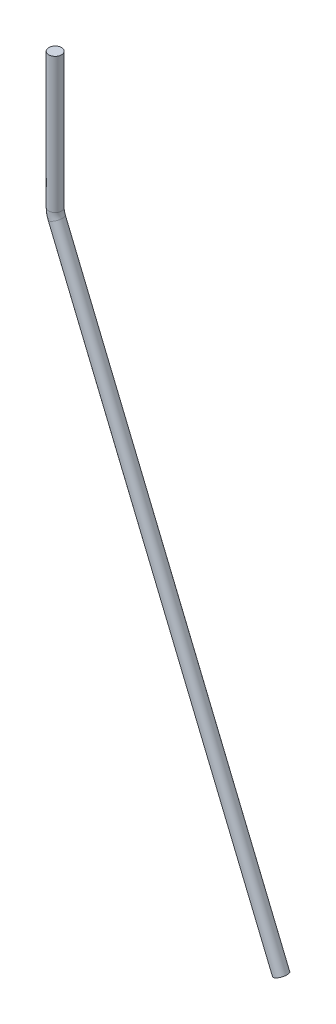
ISO-10303-21;
HEADER;
FILE_DESCRIPTION(('STEP AP214'),'2;1');
FILE_NAME('part.step','',(''),(''),'','','');
FILE_SCHEMA(('AUTOMOTIVE_DESIGN { 1 0 10303 214 1 1 1 1 }'));
ENDSEC;
DATA;
#1=APPLICATION_CONTEXT('core data for automotive mechanical design processes');
#2=APPLICATION_PROTOCOL_DEFINITION('international standard','automotive_design',2000,#1);
#3=PRODUCT_CONTEXT('',#1,'mechanical');
#4=PRODUCT('Part','Part','',(#3));
#5=PRODUCT_RELATED_PRODUCT_CATEGORY('part','',(#4));
#6=PRODUCT_DEFINITION_FORMATION('','',#4);
#7=PRODUCT_DEFINITION_CONTEXT('part definition',#1,'design');
#8=PRODUCT_DEFINITION('design','',#6,#7);
#9=PRODUCT_DEFINITION_SHAPE('','',#8);
#10=(LENGTH_UNIT() NAMED_UNIT(*) SI_UNIT(.MILLI.,.METRE.));
#11=(NAMED_UNIT(*) PLANE_ANGLE_UNIT() SI_UNIT($,.RADIAN.));
#12=(NAMED_UNIT(*) SI_UNIT($,.STERADIAN.) SOLID_ANGLE_UNIT());
#13=UNCERTAINTY_MEASURE_WITH_UNIT(LENGTH_MEASURE(1.E-05),#10,'distance_accuracy_value','');
#14=(GEOMETRIC_REPRESENTATION_CONTEXT(3) GLOBAL_UNCERTAINTY_ASSIGNED_CONTEXT((#13)) GLOBAL_UNIT_ASSIGNED_CONTEXT((#10,
#11,#12)) REPRESENTATION_CONTEXT('',''));
#15=CARTESIAN_POINT('',(0.,0.,0.));
#16=DIRECTION('',(0.,0.,1.));
#17=DIRECTION('',(1.,0.,0.));
#18=AXIS2_PLACEMENT_3D('',#15,#16,#17);
#19=CARTESIAN_POINT('',(0.757868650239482,-61.8341823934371,0.));
#20=DIRECTION('',(0.381877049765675,-0.924213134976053,0.));
#21=DIRECTION('',(0.924213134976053,0.381877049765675,0.));
#22=AXIS2_PLACEMENT_3D('',#19,#20,#21);
#23=CYLINDRICAL_SURFACE('',#22,3.);
#24=CARTESIAN_POINT('',(0.757868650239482,-61.8341823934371,0.));
#25=DIRECTION('',(-0.381877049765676,0.924213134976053,0.));
#26=DIRECTION('',(0.,0.,1.));
#27=AXIS2_PLACEMENT_3D('',#24,#25,#26);
#28=CIRCLE('',#27,3.);
#29=CARTESIAN_POINT('',(-2.01477075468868,-62.9798135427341,0.));
#30=VERTEX_POINT('',#29);
#31=EDGE_CURVE('E43',#30,#30,#28,.T.);
#32=ORIENTED_EDGE('',*,*,#31,.F.);
#33=EDGE_LOOP('',(#32));
#34=FACE_BOUND('',#33,.T.);
#35=CARTESIAN_POINT('',(106.925573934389,-318.779677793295,0.));
#36=DIRECTION('',(-0.381877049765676,0.924213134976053,0.));
#37=DIRECTION('',(0.,0.,1.));
#38=AXIS2_PLACEMENT_3D('',#35,#36,#37);
#39=CIRCLE('',#38,3.);
#40=CARTESIAN_POINT('',(106.925573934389,-318.779677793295,3.));
#41=VERTEX_POINT('',#40);
#42=EDGE_CURVE('E10',#41,#41,#39,.T.);
#43=ORIENTED_EDGE('',*,*,#42,.T.);
#44=EDGE_LOOP('',(#43));
#45=FACE_BOUND('',#44,.T.);
#46=ADVANCED_FACE('F37',(#34,#45),#23,.T.);
#47=CARTESIAN_POINT('',(10.,-58.0154118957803,0.));
#48=DIRECTION('',(0.,0.,1.));
#49=DIRECTION('',(1.,0.,0.));
#50=AXIS2_PLACEMENT_3D('',#47,#48,#49);
#51=TOROIDAL_SURFACE('',#50,10.,3.);
#52=CARTESIAN_POINT('',(0.,-58.0154118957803,0.));
#53=DIRECTION('',(0.,1.,0.));
#54=DIRECTION('',(0.,0.,1.));
#55=AXIS2_PLACEMENT_3D('',#52,#53,#54);
#56=CIRCLE('',#55,3.);
#57=CARTESIAN_POINT('',(-2.99999999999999,-58.0154118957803,0.));
#58=VERTEX_POINT('',#57);
#59=EDGE_CURVE('E47',#58,#58,#56,.T.);
#60=CARTESIAN_POINT('',(10.,-58.0154118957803,0.));
#61=DIRECTION('',(0.,0.,1.));
#62=DIRECTION('',(1.,0.,0.));
#63=AXIS2_PLACEMENT_3D('',#60,#61,#62);
#64=CIRCLE('',#63,13.);
#65=EDGE_CURVE('',#58,#30,#64,.T.);
#66=ORIENTED_EDGE('',*,*,#59,.F.);
#67=ORIENTED_EDGE('',*,*,#31,.T.);
#68=ORIENTED_EDGE('',*,*,#65,.T.);
#69=ORIENTED_EDGE('',*,*,#65,.F.);
#70=EDGE_LOOP('',(#66,#68,#67,#69));
#71=FACE_BOUND('',#70,.T.);
#72=ADVANCED_FACE('F62',(#71),#51,.T.);
#73=CARTESIAN_POINT('',(0.,-58.0154118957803,0.));
#74=DIRECTION('',(0.,1.,0.));
#75=DIRECTION('',(-1.,0.,0.));
#76=AXIS2_PLACEMENT_3D('',#73,#74,#75);
#77=CYLINDRICAL_SURFACE('',#76,3.);
#78=CARTESIAN_POINT('',(0.,6.,0.));
#79=DIRECTION('',(0.,1.,0.));
#80=DIRECTION('',(0.,0.,1.));
#81=AXIS2_PLACEMENT_3D('',#78,#79,#80);
#82=CIRCLE('',#81,3.);
#83=CARTESIAN_POINT('',(-3.,6.00000000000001,0.));
#84=VERTEX_POINT('',#83);
#85=EDGE_CURVE('E51',#84,#84,#82,.T.);
#86=CARTESIAN_POINT('',(-2.99999999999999,-58.0154118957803,0.));
#87=CARTESIAN_POINT('',(-2.99999999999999,-57.3485846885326,0.));
#88=CARTESIAN_POINT('',(-2.99999999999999,-56.6817574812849,0.));
#89=CARTESIAN_POINT('',(-2.99999999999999,-55.3481030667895,0.));
#90=CARTESIAN_POINT('',(-2.99999999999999,-54.6812758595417,0.));
#91=CARTESIAN_POINT('',(-2.99999999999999,-53.3476214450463,0.));
#92=CARTESIAN_POINT('',(-2.99999999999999,-52.6807942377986,0.));
#93=CARTESIAN_POINT('',(-2.99999999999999,-51.3471398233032,0.));
#94=CARTESIAN_POINT('',(-2.99999999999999,-50.6803126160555,0.));
#95=CARTESIAN_POINT('',(-2.99999999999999,-49.3466582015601,0.));
#96=CARTESIAN_POINT('',(-2.99999999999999,-48.6798309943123,0.));
#97=CARTESIAN_POINT('',(-2.99999999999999,-47.3461765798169,0.));
#98=CARTESIAN_POINT('',(-2.99999999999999,-46.6793493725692,0.));
#99=CARTESIAN_POINT('',(-2.99999999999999,-45.3456949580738,0.));
#100=CARTESIAN_POINT('',(-3.,-44.6788677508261,0.));
#101=CARTESIAN_POINT('',(-3.,-43.3452133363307,0.));
#102=CARTESIAN_POINT('',(-3.,-42.6783861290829,0.));
#103=CARTESIAN_POINT('',(-3.,-41.3447317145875,0.));
#104=CARTESIAN_POINT('',(-3.,-40.6779045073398,0.));
#105=CARTESIAN_POINT('',(-3.,-39.3442500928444,0.));
#106=CARTESIAN_POINT('',(-3.,-38.6774228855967,0.));
#107=CARTESIAN_POINT('',(-3.,-37.3437684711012,0.));
#108=CARTESIAN_POINT('',(-3.,-36.6769412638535,0.));
#109=CARTESIAN_POINT('',(-3.,-35.3432868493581,0.));
#110=CARTESIAN_POINT('',(-3.,-34.6764596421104,0.));
#111=CARTESIAN_POINT('',(-3.,-33.342805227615,0.));
#112=CARTESIAN_POINT('',(-3.,-32.6759780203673,0.));
#113=CARTESIAN_POINT('',(-3.,-31.3423236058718,0.));
#114=CARTESIAN_POINT('',(-3.,-30.6754963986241,0.));
#115=CARTESIAN_POINT('',(-3.,-29.3418419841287,0.));
#116=CARTESIAN_POINT('',(-3.,-28.675014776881,0.));
#117=CARTESIAN_POINT('',(-3.,-27.3413603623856,0.));
#118=CARTESIAN_POINT('',(-3.,-26.6745331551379,0.));
#119=CARTESIAN_POINT('',(-3.,-25.3408787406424,0.));
#120=CARTESIAN_POINT('',(-3.,-24.6740515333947,0.));
#121=CARTESIAN_POINT('',(-3.,-23.3403971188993,0.));
#122=CARTESIAN_POINT('',(-3.,-22.6735699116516,0.));
#123=CARTESIAN_POINT('',(-3.,-21.3399154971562,0.));
#124=CARTESIAN_POINT('',(-3.,-20.6730882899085,0.));
#125=CARTESIAN_POINT('',(-3.,-19.339433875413,0.));
#126=CARTESIAN_POINT('',(-3.,-18.6726066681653,0.));
#127=CARTESIAN_POINT('',(-3.,-17.3389522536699,0.));
#128=CARTESIAN_POINT('',(-3.,-16.6721250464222,0.));
#129=CARTESIAN_POINT('',(-3.,-15.3384706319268,0.));
#130=CARTESIAN_POINT('',(-3.,-14.671643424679,0.));
#131=CARTESIAN_POINT('',(-3.,-13.3379890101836,0.));
#132=CARTESIAN_POINT('',(-3.,-12.6711618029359,0.));
#133=CARTESIAN_POINT('',(-3.,-11.3375073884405,0.));
#134=CARTESIAN_POINT('',(-3.,-10.6706801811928,0.));
#135=CARTESIAN_POINT('',(-3.,-9.33702576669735,0.));
#136=CARTESIAN_POINT('',(-3.,-8.67019855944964,0.));
#137=CARTESIAN_POINT('',(-3.,-7.33654414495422,0.));
#138=CARTESIAN_POINT('',(-3.,-6.66971693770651,0.));
#139=CARTESIAN_POINT('',(-3.,-5.33606252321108,0.));
#140=CARTESIAN_POINT('',(-3.,-4.66923531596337,0.));
#141=CARTESIAN_POINT('',(-3.,-3.33558090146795,0.));
#142=CARTESIAN_POINT('',(-3.,-2.66875369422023,0.));
#143=CARTESIAN_POINT('',(-3.,-1.33509927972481,0.));
#144=CARTESIAN_POINT('',(-3.,-0.668272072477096,0.));
#145=CARTESIAN_POINT('',(-3.,0.665382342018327,0.));
#146=CARTESIAN_POINT('',(-3.,1.33220954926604,0.));
#147=CARTESIAN_POINT('',(-3.,2.66586396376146,0.));
#148=CARTESIAN_POINT('',(-3.,3.33269117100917,0.));
#149=CARTESIAN_POINT('',(-3.,4.66634558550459,0.));
#150=CARTESIAN_POINT('',(-3.,5.3331727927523,0.));
#151=CARTESIAN_POINT('',(-3.,6.00000000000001,0.));
#152=B_SPLINE_CURVE_WITH_KNOTS('',3,(#86,#87,#88,#89,#90,#91,#92,#93,#94,#95,#96,#97,#98,#99,
#100,#101,#102,#103,#104,#105,#106,#107,#108,#109,#110,#111,#112,#113,#114,#115,#116,#117,#118,
#119,#120,#121,#122,#123,#124,#125,#126,#127,#128,#129,#130,#131,#132,#133,#134,#135,#136,#137,
#138,#139,#140,#141,#142,#143,#144,#145,#146,#147,#148,#149,#150,#151),.UNSPECIFIED.,.F.,.F.,(4,
2,2,2,2,2,2,2,2,2,2,2,2,2,2,2,2,2,2,2,2,2,2,2,2,2,2,2,2,2,2,2,4),(0.,2.00048162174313,
4.00096324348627,6.0014448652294,8.00192648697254,10.0024081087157,12.0028897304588,
14.0033713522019,16.0038529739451,18.0043345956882,20.0048162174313,22.0052978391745,
24.0057794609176,26.0062610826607,28.0067427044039,30.007224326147,32.0077059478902,
34.0081875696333,36.0086691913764,38.0091508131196,40.0096324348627,42.0101140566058,
44.010595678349,46.0110773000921,48.0115589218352,50.0120405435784,52.0125221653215,
54.0130037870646,56.0134854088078,58.0139670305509,60.0144486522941,62.0149302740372,
64.0154118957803),.UNSPECIFIED.);
#153=EDGE_CURVE('BSEAM59',#58,#84,#152,.T.);
#154=ORIENTED_EDGE('',*,*,#59,.T.);
#155=ORIENTED_EDGE('',*,*,#85,.F.);
#156=ORIENTED_EDGE('',*,*,#153,.T.);
#157=ORIENTED_EDGE('',*,*,#153,.F.);
#158=EDGE_LOOP('',(#154,#156,#155,#157));
#159=FACE_BOUND('',#158,.T.);
#160=ADVANCED_FACE('F59',(#159),#77,.T.);
#161=CARTESIAN_POINT('',(106.925573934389,-318.779677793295,0.));
#162=DIRECTION('',(-0.381877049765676,0.924213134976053,0.));
#163=DIRECTION('',(0.,0.,1.));
#164=AXIS2_PLACEMENT_3D('',#161,#162,#163);
#165=PLANE('',#164);
#166=ORIENTED_EDGE('',*,*,#42,.F.);
#167=EDGE_LOOP('',(#166));
#168=FACE_BOUND('',#167,.T.);
#169=ADVANCED_FACE('F61',(#168),#165,.F.);
#170=CARTESIAN_POINT('',(0.,6.,0.));
#171=DIRECTION('',(0.,1.,0.));
#172=DIRECTION('',(0.,0.,1.));
#173=AXIS2_PLACEMENT_3D('',#170,#171,#172);
#174=PLANE('',#173);
#175=ORIENTED_EDGE('',*,*,#85,.T.);
#176=EDGE_LOOP('',(#175));
#177=FACE_BOUND('',#176,.T.);
#178=ADVANCED_FACE('F57',(#177),#174,.T.);
#179=CLOSED_SHELL('',(#46,#72,#160,#169,#178));
#180=MANIFOLD_SOLID_BREP('B2',#179);
#181=ADVANCED_BREP_SHAPE_REPRESENTATION('',(#18,#180),#14);
#182=SHAPE_DEFINITION_REPRESENTATION(#9,#181);
ENDSEC;
END-ISO-10303-21;
